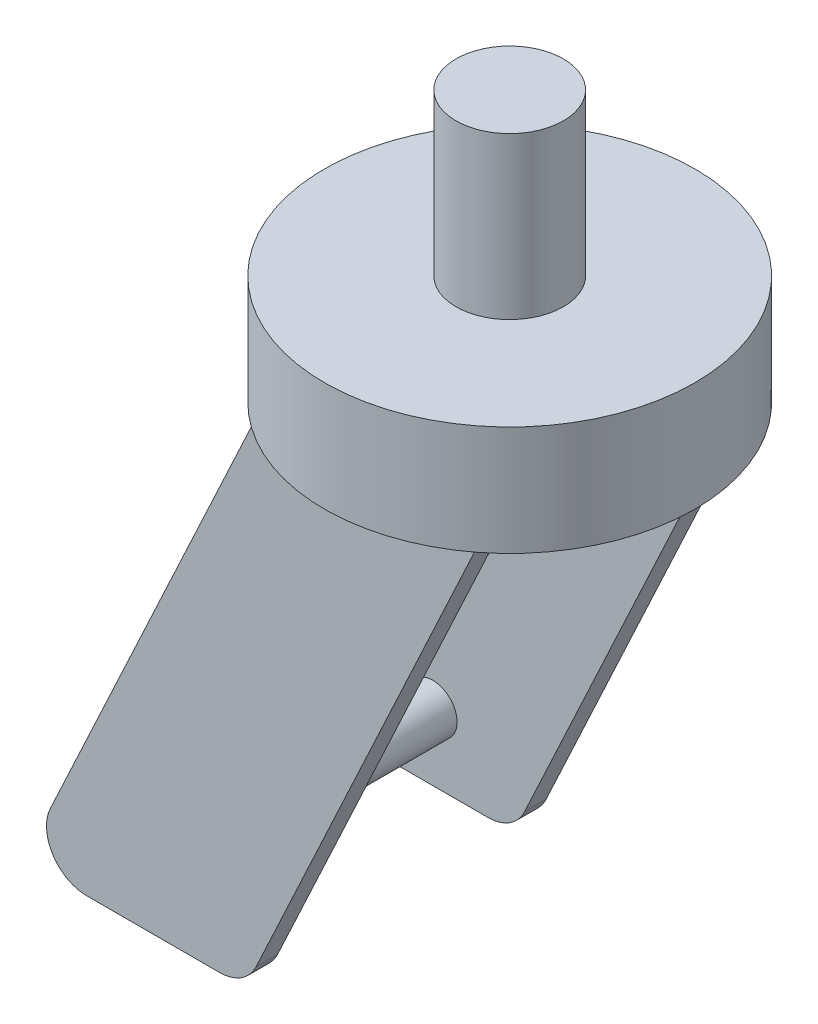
from build123d import *

# Parameters (mm, degrees)
ESTRUSIONE_ESTRUSIONE2_DEPTH = 4
ESTRUSIONE_ESTRUSIONE3_START = -100
SCHIZZO6_R                   = 9
ESTRUSIONE_ESTRUSIONE3_DEPTH = 92


with BuildPart() as part:
    # Schizzo1 → Rivoluzione1 (revolve)
    with BuildSketch(Plane.XY):
        Polygon((0, 0), (0, 109.8), (20, 109.8), (20, 49.8), (69, 49.8), (69, 9), (51.41, 9), (51.41, 0), align=None)
    revolve(axis=Axis((0, -2388.876102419, 0), (0, 1, 0)))

    # Schizzo4 → Estrusione-Estrusione2 (add, symmetric)
    with BuildSketch(Plane.XY.offset(50)):
        with BuildLine():
            Line((-41.3, 9), (41.298871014, 9))
            Line((41.298871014, 9), (-40.463175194, -166.339273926))
            ThreePointArc((-40.463175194, -166.339273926), (-45.998297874, -172.650871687), (-54.057791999, -175))
            Line((-54.057791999, -175), (-103.555325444, -175))
            ThreePointArc((-103.555325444, -175), (-116.206197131, -168.059494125), (-117.149942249, -153.660726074))
            Line((-117.149942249, -153.660726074), (-41.3, 9))
        make_face()
    estrusione_estrusione2 = extrude(amount=ESTRUSIONE_ESTRUSIONE2_DEPTH, both=True)

    # Specchia1: Estrusione-Estrusione2 across plane
    add(estrusione_estrusione2.mirror(Plane.XY))

    # Schizzo6 → Estrusione-Estrusione3 (add)
    with BuildSketch(Plane.XY.offset(54).offset(ESTRUSIONE_ESTRUSIONE3_START)):
        with Locations((-74.59, -150)):
            Circle(SCHIZZO6_R)
    extrude(amount=ESTRUSIONE_ESTRUSIONE3_DEPTH)


solid = part.part
